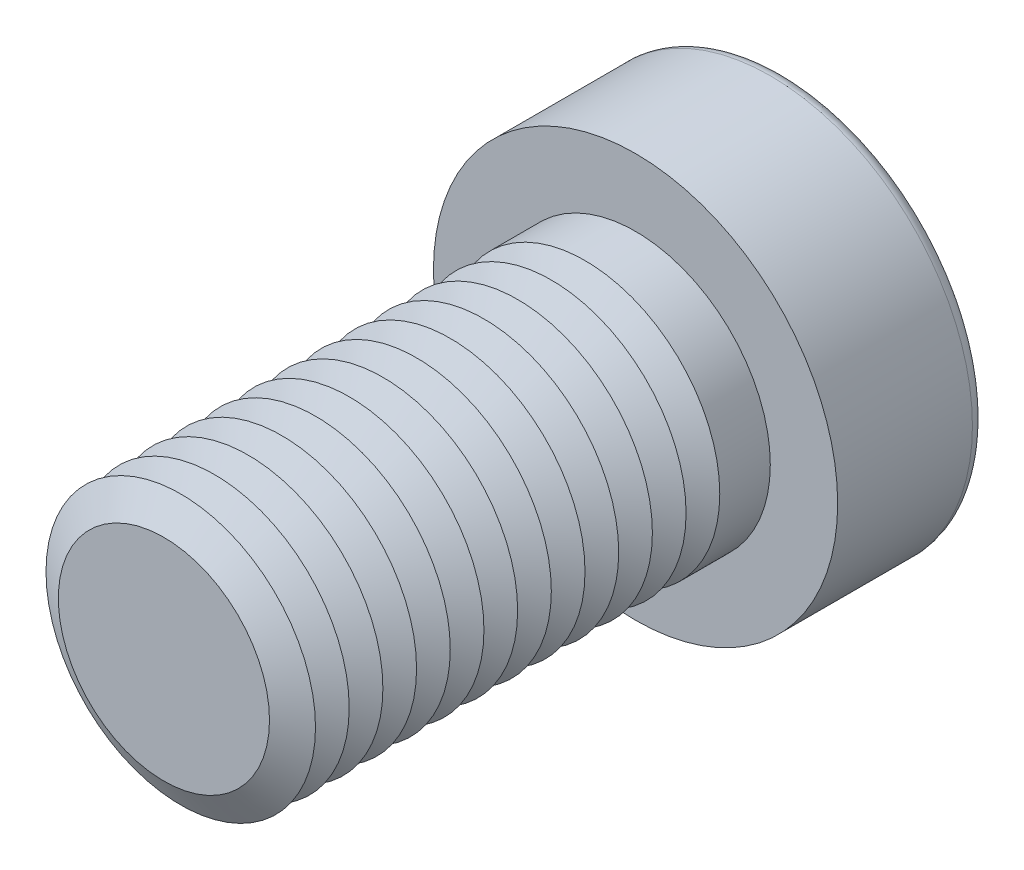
from build123d import *

# Parameters (mm, degrees)
SKETCH1_R           = 10
BOSS_EXTRUDE1_DEPTH = 35
SKETCH2_R           = 15
BOSS_EXTRUDE2_DEPTH = 11
CUT_EXTRUDE1_DEPTH  = 10.5
FILLET1_R           = 1
LPATTERN1_COUNT     = 13
LPATTERN1_PITCH     = 2.5


with BuildPart() as part:
    # Sketch1 → Boss-Extrude1 (new body)
    with BuildSketch(Plane.XY):
        Circle(SKETCH1_R)
    extrude(amount=BOSS_EXTRUDE1_DEPTH)

    # Sketch2 → Boss-Extrude2 (add)
    with BuildSketch(Plane(origin=(0, 0, 0), x_dir=(-1, 0, 0), z_dir=(0, 0, -1))):
        Circle(SKETCH2_R)
    extrude(amount=BOSS_EXTRUDE2_DEPTH)

    # Sketch3 → Cut-Extrude1 (cut)
    with BuildSketch(Plane(origin=(0, 0, -11), x_dir=(-1, 0, 0), z_dir=(0, 0, -1))):
        Polygon((-4.041451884, 7), (-8.082903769, 0), (-4.041451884, -7), (4.041451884, -7), (8.082903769, 0), (4.041451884, 7), align=None)
    extrude(amount=-CUT_EXTRUDE1_DEPTH, mode=Mode.SUBTRACT)

    # Fillet1
    fillet1_edges = [part.edges().sort_by_distance(p)[0] for p in [
        (15, 0, -11),
    ]]
    fillet(fillet1_edges, radius=FILLET1_R)

    # Cut-Extrude2 cone 1 section (on through the dimple's axis) → Cut-Extrude2 (revolve, cut)
    with BuildSketch(Plane(origin=(0, 0, -0.5), x_dir=(0, 1, 0), z_dir=(1, 0, 0))):
        Polygon((0, 0), (7, 0), (0, 4.041451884), align=None)
    revolve(axis=Axis((0, 0, -0.5), (0, 0, 1)), mode=Mode.SUBTRACT)

    # Cut-Extrude3 cone 1 section (on through the dimple's axis) → Cut-Extrude3 (revolve, cut)
    with BuildSketch(Plane(origin=(0, 0, -11), x_dir=(0, 1, 0), z_dir=(1, 0, 0))):
        Polygon((0, 0), (8.082903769, 0), (0, 2.165807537), align=None)
    revolve(axis=Axis((0, 0, -11), (0, 0, 1)), mode=Mode.SUBTRACT)

    # Sketch7 → Cut-Revolve1 (revolve, cut)
    with BuildSketch(Plane(origin=(0, 0, 0), x_dir=(0, 0, -1), z_dir=(1, 0, 0)), mode=Mode.PRIVATE) as cut_revolve1_sk:
        Polygon((-35, 7.834936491), (-33.75, 10), (-36.25, 10), align=None)
    cut_revolve1 = revolve(cut_revolve1_sk.sketch.rotate(Axis((0, 0, 35), (0, 0, -1)), 90), axis=Axis((0, 0, 35), (0, 0, -1)), mode=Mode.SUBTRACT)

    # LPattern1: Cut-Revolve1 ×13
    with Locations(*[(0, 0, -i * LPATTERN1_PITCH) for i in range(1, LPATTERN1_COUNT)]):
        add(cut_revolve1, mode=Mode.SUBTRACT)


solid = part.part
